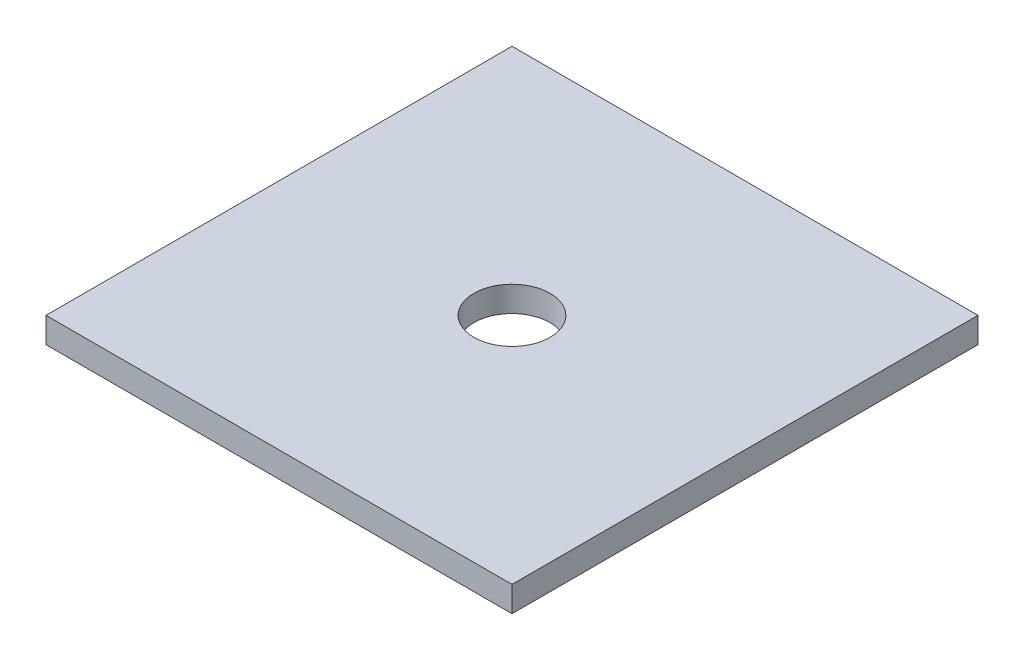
ISO-10303-21;
HEADER;
FILE_DESCRIPTION(('STEP AP214'),'2;1');
FILE_NAME('part.step','',(''),(''),'','','');
FILE_SCHEMA(('AUTOMOTIVE_DESIGN { 1 0 10303 214 1 1 1 1 }'));
ENDSEC;
DATA;
#1=APPLICATION_CONTEXT('core data for automotive mechanical design processes');
#2=APPLICATION_PROTOCOL_DEFINITION('international standard','automotive_design',2000,#1);
#3=PRODUCT_CONTEXT('',#1,'mechanical');
#4=PRODUCT('Part','Part','',(#3));
#5=PRODUCT_RELATED_PRODUCT_CATEGORY('part','',(#4));
#6=PRODUCT_DEFINITION_FORMATION('','',#4);
#7=PRODUCT_DEFINITION_CONTEXT('part definition',#1,'design');
#8=PRODUCT_DEFINITION('design','',#6,#7);
#9=PRODUCT_DEFINITION_SHAPE('','',#8);
#10=(LENGTH_UNIT() NAMED_UNIT(*) SI_UNIT(.MILLI.,.METRE.));
#11=(NAMED_UNIT(*) PLANE_ANGLE_UNIT() SI_UNIT($,.RADIAN.));
#12=(NAMED_UNIT(*) SI_UNIT($,.STERADIAN.) SOLID_ANGLE_UNIT());
#13=UNCERTAINTY_MEASURE_WITH_UNIT(LENGTH_MEASURE(1.E-05),#10,'distance_accuracy_value','');
#14=(GEOMETRIC_REPRESENTATION_CONTEXT(3) GLOBAL_UNCERTAINTY_ASSIGNED_CONTEXT((#13)) GLOBAL_UNIT_ASSIGNED_CONTEXT((#10,
#11,#12)) REPRESENTATION_CONTEXT('',''));
#15=CARTESIAN_POINT('',(0.,0.,0.));
#16=DIRECTION('',(0.,0.,1.));
#17=DIRECTION('',(1.,0.,0.));
#18=AXIS2_PLACEMENT_3D('',#15,#16,#17);
#19=CARTESIAN_POINT('',(0.,3.,-55.));
#20=DIRECTION('',(0.,-1.,0.));
#21=DIRECTION('',(0.,0.,-1.));
#22=AXIS2_PLACEMENT_3D('',#19,#20,#21);
#23=PLANE('',#22);
#24=DIRECTION('',(0.,0.,1.));
#25=VECTOR('',#24,1.);
#26=CARTESIAN_POINT('',(0.,3.,0.));
#27=LINE('',#26,#25);
#28=CARTESIAN_POINT('',(0.,3.,-55.));
#29=VERTEX_POINT('',#28);
#30=CARTESIAN_POINT('',(0.,3.,0.));
#31=VERTEX_POINT('',#30);
#32=EDGE_CURVE('E83',#29,#31,#27,.T.);
#33=ORIENTED_EDGE('',*,*,#32,.T.);
#34=DIRECTION('',(1.,0.,0.));
#35=VECTOR('',#34,1.);
#36=CARTESIAN_POINT('',(0.,3.,0.));
#37=LINE('',#36,#35);
#38=CARTESIAN_POINT('',(55.,3.,0.));
#39=VERTEX_POINT('',#38);
#40=EDGE_CURVE('E78',#31,#39,#37,.T.);
#41=ORIENTED_EDGE('',*,*,#40,.T.);
#42=DIRECTION('',(0.,0.,-1.));
#43=VECTOR('',#42,1.);
#44=CARTESIAN_POINT('',(55.,3.,0.));
#45=LINE('',#44,#43);
#46=CARTESIAN_POINT('',(55.,3.,-55.));
#47=VERTEX_POINT('',#46);
#48=EDGE_CURVE('E81',#39,#47,#45,.T.);
#49=ORIENTED_EDGE('',*,*,#48,.T.);
#50=DIRECTION('',(-1.,0.,0.));
#51=VECTOR('',#50,1.);
#52=CARTESIAN_POINT('',(0.,3.,-55.));
#53=LINE('',#52,#51);
#54=EDGE_CURVE('E48',#47,#29,#53,.T.);
#55=ORIENTED_EDGE('',*,*,#54,.T.);
#56=EDGE_LOOP('',(#33,#41,#49,#55));
#57=FACE_BOUND('',#56,.T.);
#58=CARTESIAN_POINT('',(27.5,3.,-27.5));
#59=DIRECTION('',(0.,1.,0.));
#60=DIRECTION('',(0.,0.,1.));
#61=AXIS2_PLACEMENT_3D('',#58,#59,#60);
#62=CIRCLE('',#61,4.5);
#63=CARTESIAN_POINT('',(27.5,3.,-23.));
#64=VERTEX_POINT('',#63);
#65=EDGE_CURVE('E98',#64,#64,#62,.T.);
#66=ORIENTED_EDGE('',*,*,#65,.F.);
#67=EDGE_LOOP('',(#66));
#68=FACE_BOUND('',#67,.T.);
#69=ADVANCED_FACE('F31',(#57,#68),#23,.F.);
#70=CARTESIAN_POINT('',(0.,0.,-55.));
#71=DIRECTION('',(0.,-1.,0.));
#72=DIRECTION('',(0.,0.,-1.));
#73=AXIS2_PLACEMENT_3D('',#70,#71,#72);
#74=PLANE('',#73);
#75=DIRECTION('',(0.,0.,1.));
#76=VECTOR('',#75,1.);
#77=CARTESIAN_POINT('',(0.,0.,0.));
#78=LINE('',#77,#76);
#79=CARTESIAN_POINT('',(0.,0.,-55.));
#80=VERTEX_POINT('',#79);
#81=CARTESIAN_POINT('',(0.,0.,0.));
#82=VERTEX_POINT('',#81);
#83=EDGE_CURVE('E95',#80,#82,#78,.T.);
#84=ORIENTED_EDGE('',*,*,#83,.F.);
#85=DIRECTION('',(-1.,0.,0.));
#86=VECTOR('',#85,1.);
#87=CARTESIAN_POINT('',(0.,0.,-55.));
#88=LINE('',#87,#86);
#89=CARTESIAN_POINT('',(55.,0.,-55.));
#90=VERTEX_POINT('',#89);
#91=EDGE_CURVE('E71',#90,#80,#88,.T.);
#92=ORIENTED_EDGE('',*,*,#91,.F.);
#93=DIRECTION('',(0.,0.,-1.));
#94=VECTOR('',#93,1.);
#95=CARTESIAN_POINT('',(55.,0.,0.));
#96=LINE('',#95,#94);
#97=CARTESIAN_POINT('',(55.,0.,0.));
#98=VERTEX_POINT('',#97);
#99=EDGE_CURVE('E65',#98,#90,#96,.T.);
#100=ORIENTED_EDGE('',*,*,#99,.F.);
#101=DIRECTION('',(1.,0.,0.));
#102=VECTOR('',#101,1.);
#103=CARTESIAN_POINT('',(0.,0.,0.));
#104=LINE('',#103,#102);
#105=EDGE_CURVE('E87',#82,#98,#104,.T.);
#106=ORIENTED_EDGE('',*,*,#105,.F.);
#107=EDGE_LOOP('',(#84,#92,#100,#106));
#108=FACE_BOUND('',#107,.T.);
#109=CARTESIAN_POINT('',(27.5,0.,-27.5));
#110=DIRECTION('',(0.,1.,0.));
#111=DIRECTION('',(0.,0.,1.));
#112=AXIS2_PLACEMENT_3D('',#109,#110,#111);
#113=CIRCLE('',#112,4.5);
#114=CARTESIAN_POINT('',(27.5,0.,-23.));
#115=VERTEX_POINT('',#114);
#116=EDGE_CURVE('E110',#115,#115,#113,.T.);
#117=ORIENTED_EDGE('',*,*,#116,.T.);
#118=EDGE_LOOP('',(#117));
#119=FACE_BOUND('',#118,.T.);
#120=ADVANCED_FACE('F106',(#108,#119),#74,.T.);
#121=CARTESIAN_POINT('',(0.,3.,0.));
#122=DIRECTION('',(1.,0.,0.));
#123=DIRECTION('',(0.,0.,-1.));
#124=AXIS2_PLACEMENT_3D('',#121,#122,#123);
#125=PLANE('',#124);
#126=ORIENTED_EDGE('',*,*,#83,.T.);
#127=DIRECTION('',(0.,-1.,0.));
#128=VECTOR('',#127,1.);
#129=CARTESIAN_POINT('',(0.,3.,0.));
#130=LINE('',#129,#128);
#131=EDGE_CURVE('E11',#31,#82,#130,.T.);
#132=ORIENTED_EDGE('',*,*,#131,.F.);
#133=ORIENTED_EDGE('',*,*,#32,.F.);
#134=DIRECTION('',(0.,-1.,0.));
#135=VECTOR('',#134,1.);
#136=CARTESIAN_POINT('',(0.,3.,-55.));
#137=LINE('',#136,#135);
#138=EDGE_CURVE('E91',#29,#80,#137,.T.);
#139=ORIENTED_EDGE('',*,*,#138,.T.);
#140=EDGE_LOOP('',(#126,#132,#133,#139));
#141=FACE_BOUND('',#140,.T.);
#142=ADVANCED_FACE('F33',(#141),#125,.F.);
#143=CARTESIAN_POINT('',(0.,3.,0.));
#144=DIRECTION('',(0.,0.,-1.));
#145=DIRECTION('',(-1.,0.,0.));
#146=AXIS2_PLACEMENT_3D('',#143,#144,#145);
#147=PLANE('',#146);
#148=ORIENTED_EDGE('',*,*,#105,.T.);
#149=DIRECTION('',(0.,-1.,0.));
#150=VECTOR('',#149,1.);
#151=CARTESIAN_POINT('',(55.,3.,0.));
#152=LINE('',#151,#150);
#153=EDGE_CURVE('E40',#39,#98,#152,.T.);
#154=ORIENTED_EDGE('',*,*,#153,.F.);
#155=ORIENTED_EDGE('',*,*,#40,.F.);
#156=ORIENTED_EDGE('',*,*,#131,.T.);
#157=EDGE_LOOP('',(#148,#154,#155,#156));
#158=FACE_BOUND('',#157,.T.);
#159=ADVANCED_FACE('F86',(#158),#147,.F.);
#160=CARTESIAN_POINT('',(55.,3.,0.));
#161=DIRECTION('',(-1.,0.,0.));
#162=DIRECTION('',(0.,0.,1.));
#163=AXIS2_PLACEMENT_3D('',#160,#161,#162);
#164=PLANE('',#163);
#165=ORIENTED_EDGE('',*,*,#99,.T.);
#166=DIRECTION('',(0.,-1.,0.));
#167=VECTOR('',#166,1.);
#168=CARTESIAN_POINT('',(55.,3.,-55.));
#169=LINE('',#168,#167);
#170=EDGE_CURVE('E88',#47,#90,#169,.T.);
#171=ORIENTED_EDGE('',*,*,#170,.F.);
#172=ORIENTED_EDGE('',*,*,#48,.F.);
#173=ORIENTED_EDGE('',*,*,#153,.T.);
#174=EDGE_LOOP('',(#165,#171,#172,#173));
#175=FACE_BOUND('',#174,.T.);
#176=ADVANCED_FACE('F89',(#175),#164,.F.);
#177=CARTESIAN_POINT('',(0.,3.,-55.));
#178=DIRECTION('',(0.,0.,1.));
#179=DIRECTION('',(1.,0.,0.));
#180=AXIS2_PLACEMENT_3D('',#177,#178,#179);
#181=PLANE('',#180);
#182=ORIENTED_EDGE('',*,*,#91,.T.);
#183=ORIENTED_EDGE('',*,*,#138,.F.);
#184=ORIENTED_EDGE('',*,*,#54,.F.);
#185=ORIENTED_EDGE('',*,*,#170,.T.);
#186=EDGE_LOOP('',(#182,#183,#184,#185));
#187=FACE_BOUND('',#186,.T.);
#188=ADVANCED_FACE('F103',(#187),#181,.F.);
#189=CARTESIAN_POINT('',(27.5,3.,-27.5));
#190=DIRECTION('',(0.,-1.,0.));
#191=DIRECTION('',(0.,0.,-1.));
#192=AXIS2_PLACEMENT_3D('',#189,#190,#191);
#193=CYLINDRICAL_SURFACE('',#192,4.5);
#194=ORIENTED_EDGE('',*,*,#65,.T.);
#195=EDGE_LOOP('',(#194));
#196=FACE_BOUND('',#195,.T.);
#197=ORIENTED_EDGE('',*,*,#116,.F.);
#198=EDGE_LOOP('',(#197));
#199=FACE_BOUND('',#198,.T.);
#200=ADVANCED_FACE('F116',(#196,#199),#193,.F.);
#201=CLOSED_SHELL('',(#69,#120,#142,#159,#176,#188,#200));
#202=MANIFOLD_SOLID_BREP('B2',#201);
#203=ADVANCED_BREP_SHAPE_REPRESENTATION('',(#18,#202),#14);
#204=SHAPE_DEFINITION_REPRESENTATION(#9,#203);
ENDSEC;
END-ISO-10303-21;
